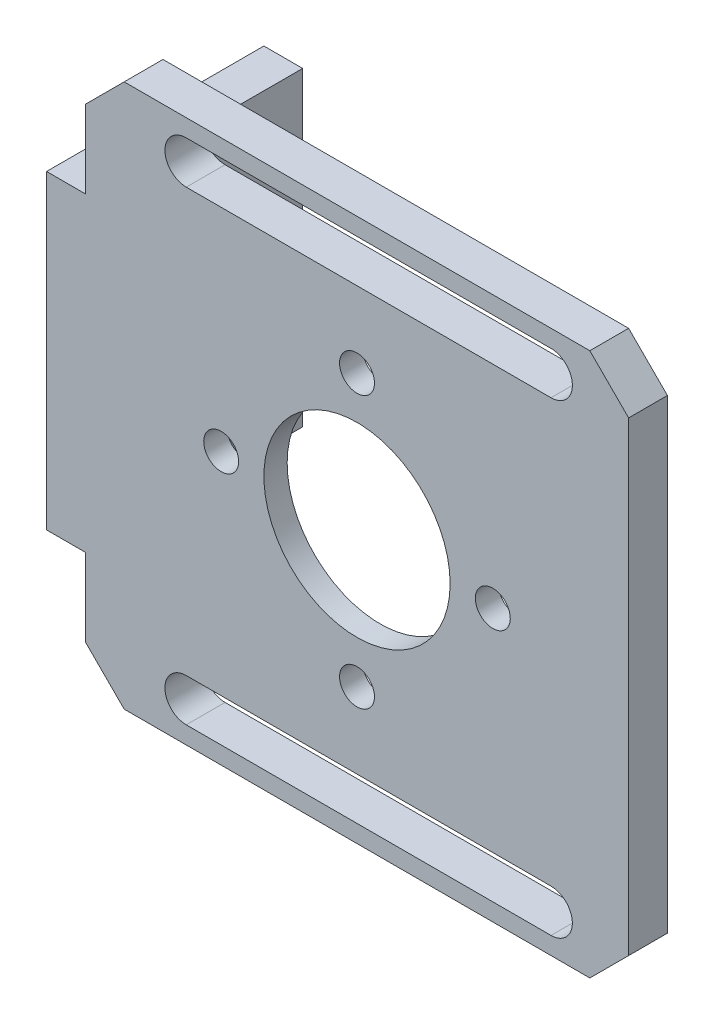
from build123d import *

# Parameters (mm, degrees)
ESQUISSE1_W                  = 70
ESQUISSE1_H                  = 70
EXTRUSION1_DEPTH             = 5
CHANFREIN1_SIZE              = 5
EXTRUSION2_DEPTH             = 23
EXTRUSION2_DEPTH_BACK        = 5
ESQUISSE2_W                  = 5
ESQUISSE2_H                  = 40
ESQUISSE3_R                  = 3.25
ENL_V_MAT_EXTRU_1_DEPTH      = 82.572054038
ESQUISSE4_R                  = 12
ENL_V_MAT_EXTRU_2_DEPTH      = 61.074953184
ESQUISSE5_R                  = 23.5
ENL_V_MAT_EXTRU_3_DEPTH      = 2
ESQUISSE6_R                  = 2.25
ENL_V_MAT_EXTRU_4_DEPTH      = 61.074953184
R_P_TITION_CIRCULAIRE1_COUNT = 4


with BuildPart() as part:
    # Esquisse1 → Extrusion1 (new body)
    with BuildSketch(Plane.XY):
        Rectangle(ESQUISSE1_W, ESQUISSE1_H)
        with BuildLine():
            Line((-22, 32.75), (25, 32.75))
            ThreePointArc((25, 32.75), (27.75, 30), (25, 27.25))
            Line((25, 27.25), (-22, 27.25))
            ThreePointArc((-22, 27.25), (-24.75, 30), (-22, 32.75))
        make_face(mode=Mode.SUBTRACT)
        with BuildLine():
            Line((-22, -27.25), (25, -27.25))
            ThreePointArc((25, -27.25), (27.75, -30), (25, -32.75))
            Line((25, -32.75), (-22, -32.75))
            ThreePointArc((-22, -32.75), (-24.75, -30), (-22, -27.25))
        make_face(mode=Mode.SUBTRACT)
    extrude(amount=EXTRUSION1_DEPTH)

    # Chanfrein1
    chanfrein1_edges = [part.edges().sort_by_distance(p)[0] for p in [
        (-35, 35, 2.5),
        (35, 35, 2.5),
        (35, -35, 2.5),
        (-35, -35, 2.5),
    ]]
    chamfer(chanfrein1_edges, length=CHANFREIN1_SIZE)

    # Esquisse2 → Extrusion2 (add, two sides: drawn at the far end of the back side and taken through both)
    with BuildSketch(Plane(origin=(0, 0, 0), x_dir=(-1, 0, 0), z_dir=(0, 0, -1)).offset(-EXTRUSION2_DEPTH_BACK)):
        with Locations((37.5, 0)):
            Rectangle(ESQUISSE2_W, ESQUISSE2_H)
    extrude(amount=EXTRUSION2_DEPTH + EXTRUSION2_DEPTH_BACK)

    # Esquisse3 → Enl_v. mat.-Extru.1 (cut, through all)
    with BuildSketch(Plane(origin=(-35, 0, 0), x_dir=(0, 0, -1), z_dir=(1, 0, 0))):
        with Locations((14, 0)):
            Circle(ESQUISSE3_R)
    extrude(amount=-ENL_V_MAT_EXTRU_1_DEPTH, mode=Mode.SUBTRACT)

    # Esquisse4 → Enl_v. mat.-Extru.2 (cut, through all)
    with BuildSketch(Plane.XY.offset(5)):
        Circle(ESQUISSE4_R)
    extrude(amount=-ENL_V_MAT_EXTRU_2_DEPTH, mode=Mode.SUBTRACT)

    # Esquisse5 → Enl_v. mat.-Extru.3 (cut)
    with BuildSketch(Plane(origin=(0, 0, 0), x_dir=(-1, 0, 0), z_dir=(0, 0, -1))):
        Circle(ESQUISSE5_R)
    extrude(amount=-ENL_V_MAT_EXTRU_3_DEPTH, mode=Mode.SUBTRACT)

    # Esquisse6 → Enl_v. mat.-Extru.4 (cut, through all)
    with BuildSketch(Plane.XY.offset(5)):
        with Locations((0, -17.5)):
            Circle(ESQUISSE6_R)
    enl_v_mat_extru_4 = extrude(amount=-ENL_V_MAT_EXTRU_4_DEPTH, mode=Mode.SUBTRACT)

    # R_p_tition circulaire1: Enl_v. mat.-Extru.4 ×4 about axis
    r_p_tition_circulaire1_axis = Axis((0, 0, 0), (0, 0, 1))
    for i in range(1, R_P_TITION_CIRCULAIRE1_COUNT):
        add(enl_v_mat_extru_4.rotate(r_p_tition_circulaire1_axis, i * 360 / R_P_TITION_CIRCULAIRE1_COUNT), mode=Mode.SUBTRACT)


solid = part.part
